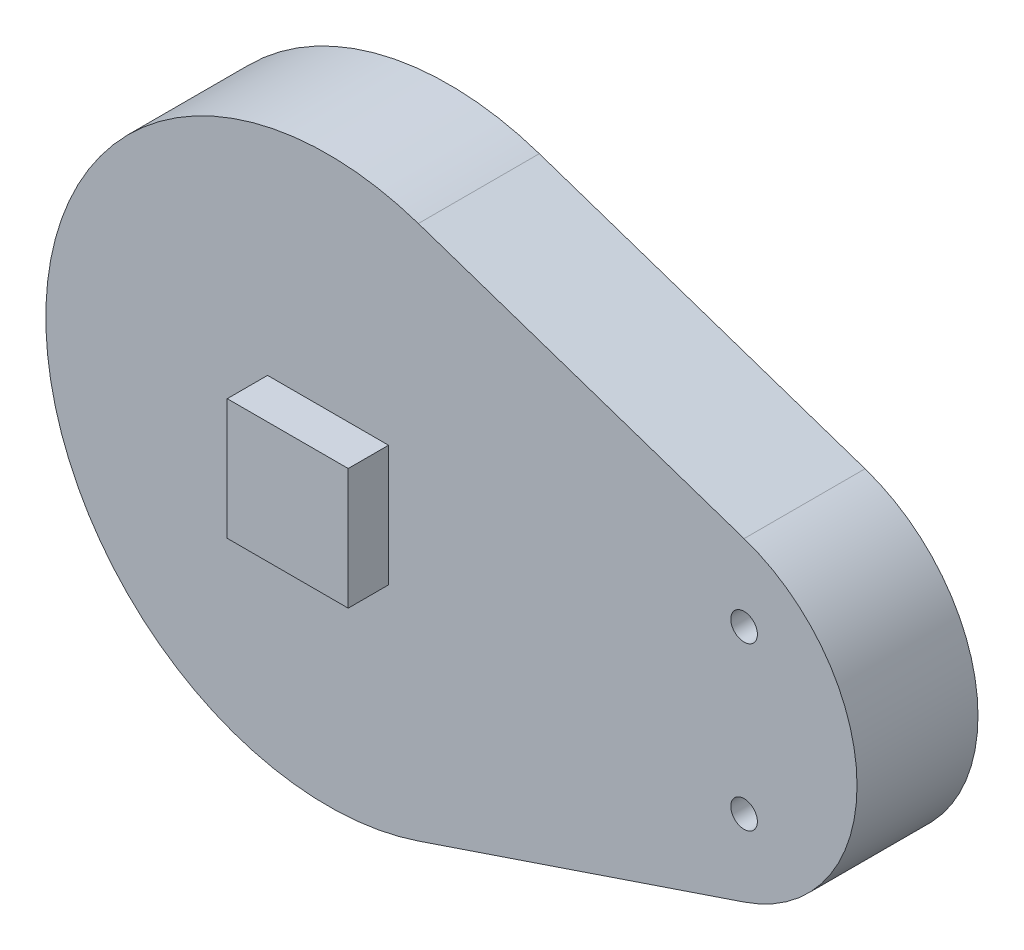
ISO-10303-21;
HEADER;
FILE_DESCRIPTION(('STEP AP214'),'2;1');
FILE_NAME('part.step','',(''),(''),'','','');
FILE_SCHEMA(('AUTOMOTIVE_DESIGN { 1 0 10303 214 1 1 1 1 }'));
ENDSEC;
DATA;
#1=APPLICATION_CONTEXT('core data for automotive mechanical design processes');
#2=APPLICATION_PROTOCOL_DEFINITION('international standard','automotive_design',2000,#1);
#3=PRODUCT_CONTEXT('',#1,'mechanical');
#4=PRODUCT('Part','Part','',(#3));
#5=PRODUCT_RELATED_PRODUCT_CATEGORY('part','',(#4));
#6=PRODUCT_DEFINITION_FORMATION('','',#4);
#7=PRODUCT_DEFINITION_CONTEXT('part definition',#1,'design');
#8=PRODUCT_DEFINITION('design','',#6,#7);
#9=PRODUCT_DEFINITION_SHAPE('','',#8);
#10=(LENGTH_UNIT() NAMED_UNIT(*) SI_UNIT(.MILLI.,.METRE.));
#11=(NAMED_UNIT(*) PLANE_ANGLE_UNIT() SI_UNIT($,.RADIAN.));
#12=(NAMED_UNIT(*) SI_UNIT($,.STERADIAN.) SOLID_ANGLE_UNIT());
#13=UNCERTAINTY_MEASURE_WITH_UNIT(LENGTH_MEASURE(1.E-05),#10,'distance_accuracy_value','');
#14=(GEOMETRIC_REPRESENTATION_CONTEXT(3) GLOBAL_UNCERTAINTY_ASSIGNED_CONTEXT((#13)) GLOBAL_UNIT_ASSIGNED_CONTEXT((#10,
#11,#12)) REPRESENTATION_CONTEXT('',''));
#15=CARTESIAN_POINT('',(0.,0.,0.));
#16=DIRECTION('',(0.,0.,1.));
#17=DIRECTION('',(1.,0.,0.));
#18=AXIS2_PLACEMENT_3D('',#15,#16,#17);
#19=CARTESIAN_POINT('',(31.8483938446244,26.8537735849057,0.));
#20=DIRECTION('',(0.,0.,1.));
#21=DIRECTION('',(1.,0.,0.));
#22=AXIS2_PLACEMENT_3D('',#19,#20,#21);
#23=PLANE('',#22);
#24=CARTESIAN_POINT('',(45.0323938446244,46.9619931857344,0.));
#25=DIRECTION('',(0.,0.,1.));
#26=DIRECTION('',(1.,0.,0.));
#27=AXIS2_PLACEMENT_3D('',#24,#25,#26);
#28=CIRCLE('',#27,3.3);
#29=CARTESIAN_POINT('',(48.3323938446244,46.9619931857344,0.));
#30=VERTEX_POINT('',#29);
#31=EDGE_CURVE('E195',#30,#30,#28,.T.);
#32=ORIENTED_EDGE('',*,*,#31,.F.);
#33=EDGE_LOOP('',(#32));
#34=FACE_BOUND('',#33,.T.);
#35=CARTESIAN_POINT('',(45.0323938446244,6.74555398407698,0.));
#36=DIRECTION('',(0.,0.,1.));
#37=DIRECTION('',(1.,0.,0.));
#38=AXIS2_PLACEMENT_3D('',#35,#36,#37);
#39=CIRCLE('',#38,3.3);
#40=CARTESIAN_POINT('',(48.3323938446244,6.74555398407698,0.));
#41=VERTEX_POINT('',#40);
#42=EDGE_CURVE('E210',#41,#41,#39,.T.);
#43=ORIENTED_EDGE('',*,*,#42,.F.);
#44=EDGE_LOOP('',(#43));
#45=FACE_BOUND('',#44,.T.);
#46=CARTESIAN_POINT('',(31.8483938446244,26.8537735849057,0.));
#47=DIRECTION('',(0.,0.,1.));
#48=DIRECTION('',(1.,0.,0.));
#49=AXIS2_PLACEMENT_3D('',#46,#47,#48);
#50=CIRCLE('',#49,41.2);
#51=CARTESIAN_POINT('',(45.0323938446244,-12.1798291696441,0.));
#52=VERTEX_POINT('',#51);
#53=CARTESIAN_POINT('',(45.0323938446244,65.8873763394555,0.));
#54=VERTEX_POINT('',#53);
#55=EDGE_CURVE('E132',#52,#54,#50,.T.);
#56=ORIENTED_EDGE('',*,*,#55,.T.);
#57=DIRECTION('',(-0.947417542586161,0.32,0.));
#58=VECTOR('',#57,1.);
#59=CARTESIAN_POINT('',(45.0323938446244,65.8873763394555,0.));
#60=LINE('',#59,#58);
#61=CARTESIAN_POINT('',(-35.7516061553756,93.1730015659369,0.));
#62=VERTEX_POINT('',#61);
#63=EDGE_CURVE('E135',#54,#62,#60,.T.);
#64=ORIENTED_EDGE('',*,*,#63,.T.);
#65=CARTESIAN_POINT('',(-58.1516061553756,26.8537735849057,0.));
#66=DIRECTION('',(0.,0.,1.));
#67=DIRECTION('',(1.,0.,0.));
#68=AXIS2_PLACEMENT_3D('',#65,#66,#67);
#69=CIRCLE('',#68,70.);
#70=CARTESIAN_POINT('',(-35.7516061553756,-39.4654543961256,0.));
#71=VERTEX_POINT('',#70);
#72=EDGE_CURVE('E152',#62,#71,#69,.T.);
#73=ORIENTED_EDGE('',*,*,#72,.T.);
#74=DIRECTION('',(0.947417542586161,0.320000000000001,0.));
#75=VECTOR('',#74,1.);
#76=CARTESIAN_POINT('',(45.0323938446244,-12.1798291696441,0.));
#77=LINE('',#76,#75);
#78=EDGE_CURVE('E143',#71,#52,#77,.T.);
#79=ORIENTED_EDGE('',*,*,#78,.T.);
#80=EDGE_LOOP('',(#56,#64,#73,#79));
#81=FACE_BOUND('',#80,.T.);
#82=DIRECTION('',(1.,0.,0.));
#83=VECTOR('',#82,1.);
#84=CARTESIAN_POINT('',(-43.1516061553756,11.8537735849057,0.));
#85=LINE('',#84,#83);
#86=CARTESIAN_POINT('',(-73.1516061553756,11.8537735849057,0.));
#87=VERTEX_POINT('',#86);
#88=CARTESIAN_POINT('',(-43.1516061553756,11.8537735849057,0.));
#89=VERTEX_POINT('',#88);
#90=EDGE_CURVE('E220',#87,#89,#85,.T.);
#91=ORIENTED_EDGE('',*,*,#90,.F.);
#92=DIRECTION('',(0.,-1.,0.));
#93=VECTOR('',#92,1.);
#94=CARTESIAN_POINT('',(-73.1516061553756,11.8537735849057,0.));
#95=LINE('',#94,#93);
#96=CARTESIAN_POINT('',(-73.1516061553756,41.8537735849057,0.));
#97=VERTEX_POINT('',#96);
#98=EDGE_CURVE('E130',#97,#87,#95,.T.);
#99=ORIENTED_EDGE('',*,*,#98,.F.);
#100=DIRECTION('',(-1.,0.,0.));
#101=VECTOR('',#100,1.);
#102=CARTESIAN_POINT('',(-43.1516061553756,41.8537735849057,0.));
#103=LINE('',#102,#101);
#104=CARTESIAN_POINT('',(-43.1516061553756,41.8537735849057,0.));
#105=VERTEX_POINT('',#104);
#106=EDGE_CURVE('E126',#105,#97,#103,.T.);
#107=ORIENTED_EDGE('',*,*,#106,.F.);
#108=DIRECTION('',(0.,1.,0.));
#109=VECTOR('',#108,1.);
#110=CARTESIAN_POINT('',(-43.1516061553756,11.8537735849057,0.));
#111=LINE('',#110,#109);
#112=EDGE_CURVE('E222',#89,#105,#111,.T.);
#113=ORIENTED_EDGE('',*,*,#112,.F.);
#114=EDGE_LOOP('',(#91,#99,#107,#113));
#115=FACE_BOUND('',#114,.T.);
#116=ADVANCED_FACE('F33',(#34,#45,#81,#115),#23,.T.);
#117=CARTESIAN_POINT('',(31.8483938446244,26.8537735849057,-30.));
#118=DIRECTION('',(0.,0.,1.));
#119=DIRECTION('',(1.,0.,0.));
#120=AXIS2_PLACEMENT_3D('',#117,#118,#119);
#121=CYLINDRICAL_SURFACE('',#120,41.2);
#122=ORIENTED_EDGE('',*,*,#55,.F.);
#123=DIRECTION('',(0.,0.,1.));
#124=VECTOR('',#123,1.);
#125=CARTESIAN_POINT('',(45.0323938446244,-12.1798291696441,-30.));
#126=LINE('',#125,#124);
#127=CARTESIAN_POINT('',(45.0323938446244,-12.1798291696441,-30.));
#128=VERTEX_POINT('',#127);
#129=EDGE_CURVE('E57',#128,#52,#126,.T.);
#130=ORIENTED_EDGE('',*,*,#129,.F.);
#131=CARTESIAN_POINT('',(31.8483938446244,26.8537735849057,-30.));
#132=DIRECTION('',(0.,0.,1.));
#133=DIRECTION('',(1.,0.,0.));
#134=AXIS2_PLACEMENT_3D('',#131,#132,#133);
#135=CIRCLE('',#134,41.2);
#136=CARTESIAN_POINT('',(45.0323938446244,65.8873763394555,-30.));
#137=VERTEX_POINT('',#136);
#138=EDGE_CURVE('E140',#128,#137,#135,.T.);
#139=ORIENTED_EDGE('',*,*,#138,.T.);
#140=DIRECTION('',(0.,0.,1.));
#141=VECTOR('',#140,1.);
#142=CARTESIAN_POINT('',(45.0323938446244,65.8873763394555,-30.));
#143=LINE('',#142,#141);
#144=EDGE_CURVE('E83',#137,#54,#143,.T.);
#145=ORIENTED_EDGE('',*,*,#144,.T.);
#146=EDGE_LOOP('',(#122,#130,#139,#145));
#147=FACE_BOUND('',#146,.T.);
#148=ADVANCED_FACE('F241',(#147),#121,.T.);
#149=CARTESIAN_POINT('',(45.0323938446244,-12.1798291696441,-30.));
#150=DIRECTION('',(0.32,-0.947417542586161,0.));
#151=DIRECTION('',(0.947417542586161,0.320000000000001,0.));
#152=AXIS2_PLACEMENT_3D('',#149,#150,#151);
#153=PLANE('',#152);
#154=ORIENTED_EDGE('',*,*,#78,.F.);
#155=DIRECTION('',(0.,0.,1.));
#156=VECTOR('',#155,1.);
#157=CARTESIAN_POINT('',(-35.7516061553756,-39.4654543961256,-30.));
#158=LINE('',#157,#156);
#159=CARTESIAN_POINT('',(-35.7516061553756,-39.4654543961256,-30.));
#160=VERTEX_POINT('',#159);
#161=EDGE_CURVE('E159',#160,#71,#158,.T.);
#162=ORIENTED_EDGE('',*,*,#161,.F.);
#163=DIRECTION('',(0.947417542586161,0.320000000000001,0.));
#164=VECTOR('',#163,1.);
#165=CARTESIAN_POINT('',(45.0323938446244,-12.1798291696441,-30.));
#166=LINE('',#165,#164);
#167=EDGE_CURVE('E148',#160,#128,#166,.T.);
#168=ORIENTED_EDGE('',*,*,#167,.T.);
#169=ORIENTED_EDGE('',*,*,#129,.T.);
#170=EDGE_LOOP('',(#154,#162,#168,#169));
#171=FACE_BOUND('',#170,.T.);
#172=ADVANCED_FACE('F249',(#171),#153,.T.);
#173=CARTESIAN_POINT('',(-58.1516061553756,26.8537735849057,-30.));
#174=DIRECTION('',(0.,0.,1.));
#175=DIRECTION('',(1.,0.,0.));
#176=AXIS2_PLACEMENT_3D('',#173,#174,#175);
#177=CYLINDRICAL_SURFACE('',#176,70.);
#178=ORIENTED_EDGE('',*,*,#72,.F.);
#179=DIRECTION('',(0.,0.,1.));
#180=VECTOR('',#179,1.);
#181=CARTESIAN_POINT('',(-35.7516061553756,93.1730015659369,-30.));
#182=LINE('',#181,#180);
#183=CARTESIAN_POINT('',(-35.7516061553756,93.1730015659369,-30.));
#184=VERTEX_POINT('',#183);
#185=EDGE_CURVE('E161',#184,#62,#182,.T.);
#186=ORIENTED_EDGE('',*,*,#185,.F.);
#187=CARTESIAN_POINT('',(-58.1516061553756,26.8537735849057,-30.));
#188=DIRECTION('',(0.,0.,1.));
#189=DIRECTION('',(1.,0.,0.));
#190=AXIS2_PLACEMENT_3D('',#187,#188,#189);
#191=CIRCLE('',#190,70.);
#192=EDGE_CURVE('E145',#184,#160,#191,.T.);
#193=ORIENTED_EDGE('',*,*,#192,.T.);
#194=ORIENTED_EDGE('',*,*,#161,.T.);
#195=EDGE_LOOP('',(#178,#186,#193,#194));
#196=FACE_BOUND('',#195,.T.);
#197=ADVANCED_FACE('F258',(#196),#177,.T.);
#198=CARTESIAN_POINT('',(45.0323938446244,65.8873763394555,-30.));
#199=DIRECTION('',(0.32,0.947417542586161,0.));
#200=DIRECTION('',(-0.947417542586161,0.32,0.));
#201=AXIS2_PLACEMENT_3D('',#198,#199,#200);
#202=PLANE('',#201);
#203=ORIENTED_EDGE('',*,*,#63,.F.);
#204=ORIENTED_EDGE('',*,*,#144,.F.);
#205=DIRECTION('',(-0.947417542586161,0.32,0.));
#206=VECTOR('',#205,1.);
#207=CARTESIAN_POINT('',(45.0323938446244,65.8873763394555,-30.));
#208=LINE('',#207,#206);
#209=EDGE_CURVE('E142',#137,#184,#208,.T.);
#210=ORIENTED_EDGE('',*,*,#209,.T.);
#211=ORIENTED_EDGE('',*,*,#185,.T.);
#212=EDGE_LOOP('',(#203,#204,#210,#211));
#213=FACE_BOUND('',#212,.T.);
#214=ADVANCED_FACE('F261',(#213),#202,.T.);
#215=CARTESIAN_POINT('',(31.8483938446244,26.8537735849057,-30.));
#216=DIRECTION('',(0.,0.,1.));
#217=DIRECTION('',(1.,0.,0.));
#218=AXIS2_PLACEMENT_3D('',#215,#216,#217);
#219=PLANE('',#218);
#220=CARTESIAN_POINT('',(45.0323938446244,46.9619931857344,-30.));
#221=DIRECTION('',(0.,0.,1.));
#222=DIRECTION('',(1.,0.,0.));
#223=AXIS2_PLACEMENT_3D('',#220,#221,#222);
#224=CIRCLE('',#223,7.5);
#225=CARTESIAN_POINT('',(52.5323938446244,46.9619931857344,-30.));
#226=VERTEX_POINT('',#225);
#227=EDGE_CURVE('E41',#226,#226,#224,.T.);
#228=ORIENTED_EDGE('',*,*,#227,.T.);
#229=EDGE_LOOP('',(#228));
#230=FACE_BOUND('',#229,.T.);
#231=CARTESIAN_POINT('',(45.0323938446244,6.74555398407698,-30.));
#232=DIRECTION('',(0.,0.,1.));
#233=DIRECTION('',(1.,0.,0.));
#234=AXIS2_PLACEMENT_3D('',#231,#232,#233);
#235=CIRCLE('',#234,7.5);
#236=CARTESIAN_POINT('',(52.5323938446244,6.74555398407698,-30.));
#237=VERTEX_POINT('',#236);
#238=EDGE_CURVE('E169',#237,#237,#235,.T.);
#239=ORIENTED_EDGE('',*,*,#238,.T.);
#240=EDGE_LOOP('',(#239));
#241=FACE_BOUND('',#240,.T.);
#242=CARTESIAN_POINT('',(-58.1516061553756,26.8537735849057,-30.));
#243=DIRECTION('',(0.,0.,1.));
#244=DIRECTION('',(1.,0.,0.));
#245=AXIS2_PLACEMENT_3D('',#242,#243,#244);
#246=CIRCLE('',#245,65.);
#247=CARTESIAN_POINT('',(6.8483938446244,26.8537735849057,-30.));
#248=VERTEX_POINT('',#247);
#249=EDGE_CURVE('E158',#248,#248,#246,.F.);
#250=ORIENTED_EDGE('',*,*,#249,.F.);
#251=EDGE_LOOP('',(#250));
#252=FACE_BOUND('',#251,.T.);
#253=ORIENTED_EDGE('',*,*,#138,.F.);
#254=ORIENTED_EDGE('',*,*,#167,.F.);
#255=ORIENTED_EDGE('',*,*,#192,.F.);
#256=ORIENTED_EDGE('',*,*,#209,.F.);
#257=EDGE_LOOP('',(#253,#254,#255,#256));
#258=FACE_BOUND('',#257,.T.);
#259=ADVANCED_FACE('F174',(#230,#241,#252,#258),#219,.F.);
#260=CARTESIAN_POINT('',(-73.1516061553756,11.8537735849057,10.));
#261=DIRECTION('',(1.,0.,0.));
#262=DIRECTION('',(0.,0.,-1.));
#263=AXIS2_PLACEMENT_3D('',#260,#261,#262);
#264=PLANE('',#263);
#265=ORIENTED_EDGE('',*,*,#98,.T.);
#266=DIRECTION('',(0.,0.,-1.));
#267=VECTOR('',#266,1.);
#268=CARTESIAN_POINT('',(-73.1516061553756,11.8537735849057,10.));
#269=LINE('',#268,#267);
#270=CARTESIAN_POINT('',(-73.1516061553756,11.8537735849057,10.));
#271=VERTEX_POINT('',#270);
#272=EDGE_CURVE('E111',#271,#87,#269,.T.);
#273=ORIENTED_EDGE('',*,*,#272,.F.);
#274=DIRECTION('',(0.,-1.,0.));
#275=VECTOR('',#274,1.);
#276=CARTESIAN_POINT('',(-73.1516061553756,11.8537735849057,10.));
#277=LINE('',#276,#275);
#278=CARTESIAN_POINT('',(-73.1516061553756,41.8537735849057,10.));
#279=VERTEX_POINT('',#278);
#280=EDGE_CURVE('E118',#279,#271,#277,.T.);
#281=ORIENTED_EDGE('',*,*,#280,.F.);
#282=DIRECTION('',(0.,0.,-1.));
#283=VECTOR('',#282,1.);
#284=CARTESIAN_POINT('',(-73.1516061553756,41.8537735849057,10.));
#285=LINE('',#284,#283);
#286=EDGE_CURVE('E218',#279,#97,#285,.T.);
#287=ORIENTED_EDGE('',*,*,#286,.T.);
#288=EDGE_LOOP('',(#265,#273,#281,#287));
#289=FACE_BOUND('',#288,.T.);
#290=ADVANCED_FACE('F128',(#289),#264,.F.);
#291=CARTESIAN_POINT('',(-43.1516061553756,11.8537735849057,10.));
#292=DIRECTION('',(0.,1.,0.));
#293=DIRECTION('',(-1.,0.,0.));
#294=AXIS2_PLACEMENT_3D('',#291,#292,#293);
#295=PLANE('',#294);
#296=ORIENTED_EDGE('',*,*,#90,.T.);
#297=DIRECTION('',(0.,0.,-1.));
#298=VECTOR('',#297,1.);
#299=CARTESIAN_POINT('',(-43.1516061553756,11.8537735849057,10.));
#300=LINE('',#299,#298);
#301=CARTESIAN_POINT('',(-43.1516061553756,11.8537735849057,10.));
#302=VERTEX_POINT('',#301);
#303=EDGE_CURVE('E114',#302,#89,#300,.T.);
#304=ORIENTED_EDGE('',*,*,#303,.F.);
#305=DIRECTION('',(1.,0.,0.));
#306=VECTOR('',#305,1.);
#307=CARTESIAN_POINT('',(-43.1516061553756,11.8537735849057,10.));
#308=LINE('',#307,#306);
#309=EDGE_CURVE('E107',#271,#302,#308,.T.);
#310=ORIENTED_EDGE('',*,*,#309,.F.);
#311=ORIENTED_EDGE('',*,*,#272,.T.);
#312=EDGE_LOOP('',(#296,#304,#310,#311));
#313=FACE_BOUND('',#312,.T.);
#314=ADVANCED_FACE('F109',(#313),#295,.F.);
#315=CARTESIAN_POINT('',(-43.1516061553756,11.8537735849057,10.));
#316=DIRECTION('',(-1.,0.,0.));
#317=DIRECTION('',(0.,0.,1.));
#318=AXIS2_PLACEMENT_3D('',#315,#316,#317);
#319=PLANE('',#318);
#320=ORIENTED_EDGE('',*,*,#112,.T.);
#321=DIRECTION('',(0.,0.,-1.));
#322=VECTOR('',#321,1.);
#323=CARTESIAN_POINT('',(-43.1516061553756,41.8537735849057,10.));
#324=LINE('',#323,#322);
#325=CARTESIAN_POINT('',(-43.1516061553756,41.8537735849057,10.));
#326=VERTEX_POINT('',#325);
#327=EDGE_CURVE('E48',#326,#105,#324,.T.);
#328=ORIENTED_EDGE('',*,*,#327,.F.);
#329=DIRECTION('',(0.,1.,0.));
#330=VECTOR('',#329,1.);
#331=CARTESIAN_POINT('',(-43.1516061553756,11.8537735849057,10.));
#332=LINE('',#331,#330);
#333=EDGE_CURVE('E117',#302,#326,#332,.T.);
#334=ORIENTED_EDGE('',*,*,#333,.F.);
#335=ORIENTED_EDGE('',*,*,#303,.T.);
#336=EDGE_LOOP('',(#320,#328,#334,#335));
#337=FACE_BOUND('',#336,.T.);
#338=ADVANCED_FACE('F229',(#337),#319,.F.);
#339=CARTESIAN_POINT('',(-43.1516061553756,41.8537735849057,10.));
#340=DIRECTION('',(0.,-1.,0.));
#341=DIRECTION('',(0.,0.,-1.));
#342=AXIS2_PLACEMENT_3D('',#339,#340,#341);
#343=PLANE('',#342);
#344=ORIENTED_EDGE('',*,*,#106,.T.);
#345=ORIENTED_EDGE('',*,*,#286,.F.);
#346=DIRECTION('',(-1.,0.,0.));
#347=VECTOR('',#346,1.);
#348=CARTESIAN_POINT('',(-43.1516061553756,41.8537735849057,10.));
#349=LINE('',#348,#347);
#350=EDGE_CURVE('E122',#326,#279,#349,.T.);
#351=ORIENTED_EDGE('',*,*,#350,.F.);
#352=ORIENTED_EDGE('',*,*,#327,.T.);
#353=EDGE_LOOP('',(#344,#345,#351,#352));
#354=FACE_BOUND('',#353,.T.);
#355=ADVANCED_FACE('F230',(#354),#343,.F.);
#356=CARTESIAN_POINT('',(0.,0.,10.));
#357=DIRECTION('',(0.,0.,1.));
#358=DIRECTION('',(1.,0.,0.));
#359=AXIS2_PLACEMENT_3D('',#356,#357,#358);
#360=PLANE('',#359);
#361=ORIENTED_EDGE('',*,*,#280,.T.);
#362=ORIENTED_EDGE('',*,*,#309,.T.);
#363=ORIENTED_EDGE('',*,*,#333,.T.);
#364=ORIENTED_EDGE('',*,*,#350,.T.);
#365=EDGE_LOOP('',(#361,#362,#363,#364));
#366=FACE_BOUND('',#365,.T.);
#367=ADVANCED_FACE('F121',(#366),#360,.T.);
#368=CARTESIAN_POINT('',(-58.1516061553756,26.8537735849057,-33.));
#369=DIRECTION('',(0.,0.,1.));
#370=DIRECTION('',(1.,0.,0.));
#371=AXIS2_PLACEMENT_3D('',#368,#369,#370);
#372=CYLINDRICAL_SURFACE('',#371,65.);
#373=CARTESIAN_POINT('',(-58.1516061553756,26.8537735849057,-33.));
#374=DIRECTION('',(0.,0.,-1.));
#375=DIRECTION('',(-1.,0.,0.));
#376=AXIS2_PLACEMENT_3D('',#373,#374,#375);
#377=CIRCLE('',#376,65.);
#378=CARTESIAN_POINT('',(-123.151606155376,26.8537735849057,-33.));
#379=VERTEX_POINT('',#378);
#380=EDGE_CURVE('E213',#379,#379,#377,.T.);
#381=ORIENTED_EDGE('',*,*,#380,.F.);
#382=EDGE_LOOP('',(#381));
#383=FACE_BOUND('',#382,.T.);
#384=ORIENTED_EDGE('',*,*,#249,.T.);
#385=EDGE_LOOP('',(#384));
#386=FACE_BOUND('',#385,.T.);
#387=ADVANCED_FACE('F237',(#383,#386),#372,.T.);
#388=CARTESIAN_POINT('',(-58.1516061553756,26.8537735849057,-33.));
#389=DIRECTION('',(0.,0.,-1.));
#390=DIRECTION('',(-1.,0.,0.));
#391=AXIS2_PLACEMENT_3D('',#388,#389,#390);
#392=PLANE('',#391);
#393=CARTESIAN_POINT('',(-58.1516061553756,26.8537735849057,-33.));
#394=DIRECTION('',(0.,0.,-1.));
#395=DIRECTION('',(-1.,0.,0.));
#396=AXIS2_PLACEMENT_3D('',#393,#394,#395);
#397=CIRCLE('',#396,30.);
#398=CARTESIAN_POINT('',(-88.1516061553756,26.8537735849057,-33.));
#399=VERTEX_POINT('',#398);
#400=EDGE_CURVE('E198',#399,#399,#397,.T.);
#401=ORIENTED_EDGE('',*,*,#400,.F.);
#402=EDGE_LOOP('',(#401));
#403=FACE_BOUND('',#402,.T.);
#404=ORIENTED_EDGE('',*,*,#380,.T.);
#405=EDGE_LOOP('',(#404));
#406=FACE_BOUND('',#405,.T.);
#407=ADVANCED_FACE('F306',(#403,#406),#392,.T.);
#408=CARTESIAN_POINT('',(45.0323938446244,6.74555398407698,-30.));
#409=DIRECTION('',(0.,0.,-1.));
#410=DIRECTION('',(-1.,0.,0.));
#411=AXIS2_PLACEMENT_3D('',#408,#409,#410);
#412=CYLINDRICAL_SURFACE('',#411,3.3);
#413=CARTESIAN_POINT('',(45.0323938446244,6.74555398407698,-25.4));
#414=DIRECTION('',(0.,0.,-1.));
#415=DIRECTION('',(-1.,0.,0.));
#416=AXIS2_PLACEMENT_3D('',#413,#414,#415);
#417=CIRCLE('',#416,3.3);
#418=CARTESIAN_POINT('',(41.7323938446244,6.74555398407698,-25.4));
#419=VERTEX_POINT('',#418);
#420=EDGE_CURVE('E207',#419,#419,#417,.T.);
#421=ORIENTED_EDGE('',*,*,#420,.T.);
#422=EDGE_LOOP('',(#421));
#423=FACE_BOUND('',#422,.T.);
#424=ORIENTED_EDGE('',*,*,#42,.T.);
#425=EDGE_LOOP('',(#424));
#426=FACE_BOUND('',#425,.T.);
#427=ADVANCED_FACE('F314',(#423,#426),#412,.F.);
#428=CARTESIAN_POINT('',(48.3323938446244,6.74555398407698,-25.4));
#429=DIRECTION('',(0.,0.,1.));
#430=DIRECTION('',(1.,0.,0.));
#431=AXIS2_PLACEMENT_3D('',#428,#429,#430);
#432=PLANE('',#431);
#433=ORIENTED_EDGE('',*,*,#420,.F.);
#434=EDGE_LOOP('',(#433));
#435=FACE_BOUND('',#434,.T.);
#436=CARTESIAN_POINT('',(45.0323938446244,6.74555398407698,-25.4));
#437=DIRECTION('',(0.,0.,-1.));
#438=DIRECTION('',(-1.,0.,0.));
#439=AXIS2_PLACEMENT_3D('',#436,#437,#438);
#440=CIRCLE('',#439,6.5);
#441=CARTESIAN_POINT('',(38.5323938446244,6.74555398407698,-25.4));
#442=VERTEX_POINT('',#441);
#443=EDGE_CURVE('E204',#442,#442,#440,.T.);
#444=ORIENTED_EDGE('',*,*,#443,.T.);
#445=EDGE_LOOP('',(#444));
#446=FACE_BOUND('',#445,.T.);
#447=ADVANCED_FACE('F318',(#435,#446),#432,.F.);
#448=CARTESIAN_POINT('',(45.0323938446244,6.74555398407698,-30.));
#449=DIRECTION('',(0.,0.,-1.));
#450=DIRECTION('',(-1.,0.,0.));
#451=AXIS2_PLACEMENT_3D('',#448,#449,#450);
#452=CYLINDRICAL_SURFACE('',#451,6.5);
#453=CARTESIAN_POINT('',(45.0323938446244,6.74555398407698,-29.));
#454=DIRECTION('',(0.,0.,1.));
#455=DIRECTION('',(1.,0.,0.));
#456=AXIS2_PLACEMENT_3D('',#453,#454,#455);
#457=CIRCLE('',#456,6.5);
#458=CARTESIAN_POINT('',(51.5323938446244,6.74555398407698,-29.));
#459=VERTEX_POINT('',#458);
#460=EDGE_CURVE('E11',#459,#459,#457,.F.);
#461=ORIENTED_EDGE('',*,*,#460,.T.);
#462=EDGE_LOOP('',(#461));
#463=FACE_BOUND('',#462,.T.);
#464=ORIENTED_EDGE('',*,*,#443,.F.);
#465=EDGE_LOOP('',(#464));
#466=FACE_BOUND('',#465,.T.);
#467=ADVANCED_FACE('F327',(#463,#466),#452,.F.);
#468=CARTESIAN_POINT('',(45.0323938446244,46.9619931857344,-30.));
#469=DIRECTION('',(0.,0.,-1.));
#470=DIRECTION('',(-1.,0.,0.));
#471=AXIS2_PLACEMENT_3D('',#468,#469,#470);
#472=CYLINDRICAL_SURFACE('',#471,3.3);
#473=CARTESIAN_POINT('',(45.0323938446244,46.9619931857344,-25.4));
#474=DIRECTION('',(0.,0.,-1.));
#475=DIRECTION('',(-1.,0.,0.));
#476=AXIS2_PLACEMENT_3D('',#473,#474,#475);
#477=CIRCLE('',#476,3.30000000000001);
#478=CARTESIAN_POINT('',(41.7323938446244,46.9619931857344,-25.4));
#479=VERTEX_POINT('',#478);
#480=EDGE_CURVE('E191',#479,#479,#477,.T.);
#481=ORIENTED_EDGE('',*,*,#480,.T.);
#482=EDGE_LOOP('',(#481));
#483=FACE_BOUND('',#482,.T.);
#484=ORIENTED_EDGE('',*,*,#31,.T.);
#485=EDGE_LOOP('',(#484));
#486=FACE_BOUND('',#485,.T.);
#487=ADVANCED_FACE('F337',(#483,#486),#472,.F.);
#488=CARTESIAN_POINT('',(48.3323938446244,46.9619931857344,-25.4));
#489=DIRECTION('',(0.,0.,1.));
#490=DIRECTION('',(1.,0.,0.));
#491=AXIS2_PLACEMENT_3D('',#488,#489,#490);
#492=PLANE('',#491);
#493=ORIENTED_EDGE('',*,*,#480,.F.);
#494=EDGE_LOOP('',(#493));
#495=FACE_BOUND('',#494,.T.);
#496=CARTESIAN_POINT('',(45.0323938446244,46.9619931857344,-25.4));
#497=DIRECTION('',(0.,0.,-1.));
#498=DIRECTION('',(-1.,0.,0.));
#499=AXIS2_PLACEMENT_3D('',#496,#497,#498);
#500=CIRCLE('',#499,6.5);
#501=CARTESIAN_POINT('',(38.5323938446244,46.9619931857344,-25.4));
#502=VERTEX_POINT('',#501);
#503=EDGE_CURVE('E189',#502,#502,#500,.T.);
#504=ORIENTED_EDGE('',*,*,#503,.T.);
#505=EDGE_LOOP('',(#504));
#506=FACE_BOUND('',#505,.T.);
#507=ADVANCED_FACE('F185',(#495,#506),#492,.F.);
#508=CARTESIAN_POINT('',(45.0323938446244,46.9619931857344,-30.));
#509=DIRECTION('',(0.,0.,-1.));
#510=DIRECTION('',(-1.,0.,0.));
#511=AXIS2_PLACEMENT_3D('',#508,#509,#510);
#512=CYLINDRICAL_SURFACE('',#511,6.5);
#513=CARTESIAN_POINT('',(45.0323938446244,46.9619931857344,-29.));
#514=DIRECTION('',(0.,0.,1.));
#515=DIRECTION('',(1.,0.,0.));
#516=AXIS2_PLACEMENT_3D('',#513,#514,#515);
#517=CIRCLE('',#516,6.5);
#518=CARTESIAN_POINT('',(51.5323938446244,46.9619931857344,-29.));
#519=VERTEX_POINT('',#518);
#520=EDGE_CURVE('E166',#519,#519,#517,.F.);
#521=ORIENTED_EDGE('',*,*,#520,.T.);
#522=EDGE_LOOP('',(#521));
#523=FACE_BOUND('',#522,.T.);
#524=ORIENTED_EDGE('',*,*,#503,.F.);
#525=EDGE_LOOP('',(#524));
#526=FACE_BOUND('',#525,.T.);
#527=ADVANCED_FACE('F180',(#523,#526),#512,.F.);
#528=CARTESIAN_POINT('',(45.0323938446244,46.9619931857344,-29.));
#529=DIRECTION('',(0.,0.,1.));
#530=DIRECTION('',(1.,0.,0.));
#531=AXIS2_PLACEMENT_3D('',#528,#529,#530);
#532=TOROIDAL_SURFACE('',#531,7.5,1.);
#533=ORIENTED_EDGE('',*,*,#227,.F.);
#534=EDGE_LOOP('',(#533));
#535=FACE_BOUND('',#534,.T.);
#536=ORIENTED_EDGE('',*,*,#520,.F.);
#537=EDGE_LOOP('',(#536));
#538=FACE_BOUND('',#537,.T.);
#539=ADVANCED_FACE('F177',(#535,#538),#532,.T.);
#540=CARTESIAN_POINT('',(45.0323938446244,6.74555398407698,-29.));
#541=DIRECTION('',(0.,0.,1.));
#542=DIRECTION('',(1.,0.,0.));
#543=AXIS2_PLACEMENT_3D('',#540,#541,#542);
#544=TOROIDAL_SURFACE('',#543,7.5,1.);
#545=ORIENTED_EDGE('',*,*,#238,.F.);
#546=EDGE_LOOP('',(#545));
#547=FACE_BOUND('',#546,.T.);
#548=ORIENTED_EDGE('',*,*,#460,.F.);
#549=EDGE_LOOP('',(#548));
#550=FACE_BOUND('',#549,.T.);
#551=ADVANCED_FACE('F35',(#547,#550),#544,.T.);
#552=CARTESIAN_POINT('',(-58.1516061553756,26.8537735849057,-23.));
#553=DIRECTION('',(0.,0.,-1.));
#554=DIRECTION('',(-1.,0.,0.));
#555=AXIS2_PLACEMENT_3D('',#552,#553,#554);
#556=CYLINDRICAL_SURFACE('',#555,30.);
#557=CARTESIAN_POINT('',(-58.1516061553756,26.8537735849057,-23.));
#558=DIRECTION('',(0.,0.,-1.));
#559=DIRECTION('',(-1.,0.,0.));
#560=AXIS2_PLACEMENT_3D('',#557,#558,#559);
#561=CIRCLE('',#560,30.);
#562=CARTESIAN_POINT('',(-88.1516061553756,26.8537735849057,-23.));
#563=VERTEX_POINT('',#562);
#564=EDGE_CURVE('E192',#563,#563,#561,.T.);
#565=ORIENTED_EDGE('',*,*,#564,.F.);
#566=EDGE_LOOP('',(#565));
#567=FACE_BOUND('',#566,.T.);
#568=ORIENTED_EDGE('',*,*,#400,.T.);
#569=EDGE_LOOP('',(#568));
#570=FACE_BOUND('',#569,.T.);
#571=ADVANCED_FACE('F364',(#567,#570),#556,.F.);
#572=CARTESIAN_POINT('',(-58.1516061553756,26.8537735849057,-23.));
#573=DIRECTION('',(0.,0.,-1.));
#574=DIRECTION('',(-1.,0.,0.));
#575=AXIS2_PLACEMENT_3D('',#572,#573,#574);
#576=PLANE('',#575);
#577=ORIENTED_EDGE('',*,*,#564,.T.);
#578=EDGE_LOOP('',(#577));
#579=FACE_BOUND('',#578,.T.);
#580=ADVANCED_FACE('F372',(#579),#576,.T.);
#581=CLOSED_SHELL('',(#116,#148,#172,#197,#214,#259,#290,#314,#338,#355,#367,#387,#407,#427,
#447,#467,#487,#507,#527,#539,#551,#571,#580));
#582=MANIFOLD_SOLID_BREP('B2',#581);
#583=ADVANCED_BREP_SHAPE_REPRESENTATION('',(#18,#582),#14);
#584=SHAPE_DEFINITION_REPRESENTATION(#9,#583);
ENDSEC;
END-ISO-10303-21;
